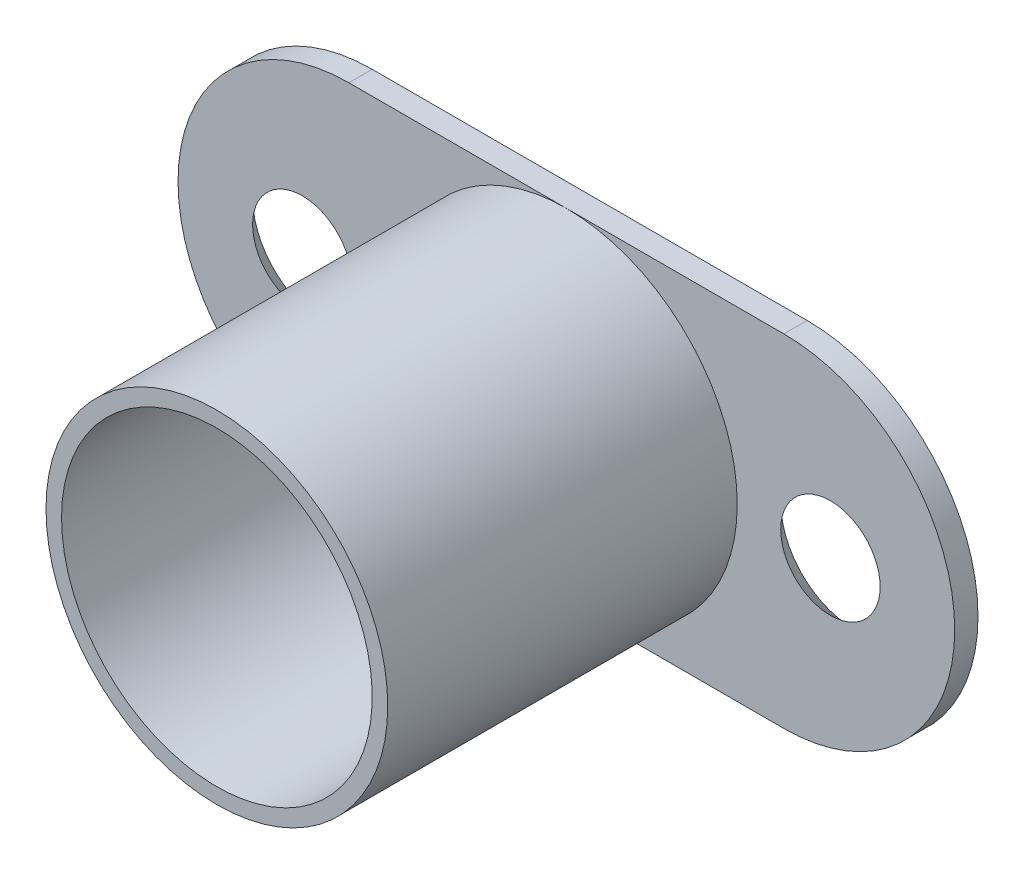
ISO-10303-21;
HEADER;
FILE_DESCRIPTION(('STEP AP214'),'2;1');
FILE_NAME('part.step','',(''),(''),'','','');
FILE_SCHEMA(('AUTOMOTIVE_DESIGN { 1 0 10303 214 1 1 1 1 }'));
ENDSEC;
DATA;
#1=APPLICATION_CONTEXT('core data for automotive mechanical design processes');
#2=APPLICATION_PROTOCOL_DEFINITION('international standard','automotive_design',2000,#1);
#3=PRODUCT_CONTEXT('',#1,'mechanical');
#4=PRODUCT('Part','Part','',(#3));
#5=PRODUCT_RELATED_PRODUCT_CATEGORY('part','',(#4));
#6=PRODUCT_DEFINITION_FORMATION('','',#4);
#7=PRODUCT_DEFINITION_CONTEXT('part definition',#1,'design');
#8=PRODUCT_DEFINITION('design','',#6,#7);
#9=PRODUCT_DEFINITION_SHAPE('','',#8);
#10=(LENGTH_UNIT() NAMED_UNIT(*) SI_UNIT(.MILLI.,.METRE.));
#11=(NAMED_UNIT(*) PLANE_ANGLE_UNIT() SI_UNIT($,.RADIAN.));
#12=(NAMED_UNIT(*) SI_UNIT($,.STERADIAN.) SOLID_ANGLE_UNIT());
#13=UNCERTAINTY_MEASURE_WITH_UNIT(LENGTH_MEASURE(1.E-05),#10,'distance_accuracy_value','');
#14=(GEOMETRIC_REPRESENTATION_CONTEXT(3) GLOBAL_UNCERTAINTY_ASSIGNED_CONTEXT((#13)) GLOBAL_UNIT_ASSIGNED_CONTEXT((#10,
#11,#12)) REPRESENTATION_CONTEXT('',''));
#15=CARTESIAN_POINT('',(0.,0.,0.));
#16=DIRECTION('',(0.,0.,1.));
#17=DIRECTION('',(1.,0.,0.));
#18=AXIS2_PLACEMENT_3D('',#15,#16,#17);
#19=CARTESIAN_POINT('',(0.,0.,0.));
#20=DIRECTION('',(0.,0.,1.));
#21=DIRECTION('',(1.,0.,0.));
#22=AXIS2_PLACEMENT_3D('',#19,#20,#21);
#23=PLANE('',#22);
#24=CARTESIAN_POINT('',(-3.,0.,0.));
#25=DIRECTION('',(0.,0.,1.));
#26=DIRECTION('',(1.,0.,0.));
#27=AXIS2_PLACEMENT_3D('',#24,#25,#26);
#28=CIRCLE('',#27,3.2);
#29=CARTESIAN_POINT('',(0.200000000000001,0.,0.));
#30=VERTEX_POINT('',#29);
#31=EDGE_CURVE('E134',#30,#30,#28,.T.);
#32=ORIENTED_EDGE('',*,*,#31,.F.);
#33=EDGE_LOOP('',(#32));
#34=FACE_BOUND('',#33,.T.);
#35=CARTESIAN_POINT('',(14.,0.,0.));
#36=DIRECTION('',(0.,0.,1.));
#37=DIRECTION('',(1.,0.,0.));
#38=AXIS2_PLACEMENT_3D('',#35,#36,#37);
#39=CIRCLE('',#38,11.);
#40=CARTESIAN_POINT('',(14.,11.,0.));
#41=VERTEX_POINT('',#40);
#42=CARTESIAN_POINT('',(14.,-11.,0.));
#43=VERTEX_POINT('',#42);
#44=EDGE_CURVE('E35',#41,#43,#39,.T.);
#45=ORIENTED_EDGE('',*,*,#44,.F.);
#46=DIRECTION('',(-1.,0.,0.));
#47=VECTOR('',#46,1.);
#48=CARTESIAN_POINT('',(0.,11.,0.));
#49=LINE('',#48,#47);
#50=CARTESIAN_POINT('',(0.,11.,0.));
#51=VERTEX_POINT('',#50);
#52=EDGE_CURVE('E79',#41,#51,#49,.T.);
#53=ORIENTED_EDGE('',*,*,#52,.T.);
#54=CARTESIAN_POINT('',(0.,0.,0.));
#55=DIRECTION('',(0.,0.,1.));
#56=DIRECTION('',(1.,0.,0.));
#57=AXIS2_PLACEMENT_3D('',#54,#55,#56);
#58=CIRCLE('',#57,11.);
#59=CARTESIAN_POINT('',(0.,-11.,0.));
#60=VERTEX_POINT('',#59);
#61=EDGE_CURVE('E154',#51,#60,#58,.T.);
#62=ORIENTED_EDGE('',*,*,#61,.T.);
#63=DIRECTION('',(1.,0.,0.));
#64=VECTOR('',#63,1.);
#65=CARTESIAN_POINT('',(0.,-11.,0.));
#66=LINE('',#65,#64);
#67=EDGE_CURVE('E89',#60,#43,#66,.T.);
#68=ORIENTED_EDGE('',*,*,#67,.T.);
#69=EDGE_LOOP('',(#45,#53,#62,#68));
#70=FACE_BOUND('',#69,.T.);
#71=ADVANCED_FACE('F24',(#34,#70),#23,.T.);
#72=CARTESIAN_POINT('',(0.,0.,-1.5));
#73=DIRECTION('',(0.,0.,1.));
#74=DIRECTION('',(1.,0.,0.));
#75=AXIS2_PLACEMENT_3D('',#72,#73,#74);
#76=CYLINDRICAL_SURFACE('',#75,11.);
#77=ORIENTED_EDGE('',*,*,#61,.F.);
#78=DIRECTION('',(0.,0.,1.));
#79=VECTOR('',#78,1.);
#80=CARTESIAN_POINT('',(0.,11.,-1.5));
#81=LINE('',#80,#79);
#82=CARTESIAN_POINT('',(0.,11.,-1.5));
#83=VERTEX_POINT('',#82);
#84=EDGE_CURVE('E33',#83,#51,#81,.T.);
#85=ORIENTED_EDGE('',*,*,#84,.F.);
#86=CARTESIAN_POINT('',(0.,0.,-1.5));
#87=DIRECTION('',(0.,0.,1.));
#88=DIRECTION('',(1.,0.,0.));
#89=AXIS2_PLACEMENT_3D('',#86,#87,#88);
#90=CIRCLE('',#89,11.);
#91=CARTESIAN_POINT('',(0.,-11.,-1.5));
#92=VERTEX_POINT('',#91);
#93=EDGE_CURVE('E78',#83,#92,#90,.T.);
#94=ORIENTED_EDGE('',*,*,#93,.T.);
#95=DIRECTION('',(0.,0.,1.));
#96=VECTOR('',#95,1.);
#97=CARTESIAN_POINT('',(0.,-11.,-1.5));
#98=LINE('',#97,#96);
#99=EDGE_CURVE('E168',#92,#60,#98,.T.);
#100=ORIENTED_EDGE('',*,*,#99,.T.);
#101=EDGE_LOOP('',(#77,#85,#94,#100));
#102=FACE_BOUND('',#101,.T.);
#103=ADVANCED_FACE('F26',(#102),#76,.T.);
#104=CARTESIAN_POINT('',(0.,11.,-1.5));
#105=DIRECTION('',(0.,1.,0.));
#106=DIRECTION('',(-1.,0.,0.));
#107=AXIS2_PLACEMENT_3D('',#104,#105,#106);
#108=PLANE('',#107);
#109=CARTESIAN_POINT('',(28.,11.,0.));
#110=VERTEX_POINT('',#109);
#111=EDGE_CURVE('E72',#110,#41,#49,.T.);
#112=ORIENTED_EDGE('',*,*,#111,.F.);
#113=DIRECTION('',(0.,0.,1.));
#114=VECTOR('',#113,1.);
#115=CARTESIAN_POINT('',(28.,11.,-1.5));
#116=LINE('',#115,#114);
#117=CARTESIAN_POINT('',(28.,11.,-1.5));
#118=VERTEX_POINT('',#117);
#119=EDGE_CURVE('E170',#118,#110,#116,.T.);
#120=ORIENTED_EDGE('',*,*,#119,.F.);
#121=DIRECTION('',(-1.,0.,0.));
#122=VECTOR('',#121,1.);
#123=CARTESIAN_POINT('',(0.,11.,-1.5));
#124=LINE('',#123,#122);
#125=EDGE_CURVE('E166',#118,#83,#124,.T.);
#126=ORIENTED_EDGE('',*,*,#125,.T.);
#127=ORIENTED_EDGE('',*,*,#84,.T.);
#128=ORIENTED_EDGE('',*,*,#52,.F.);
#129=EDGE_LOOP('',(#112,#120,#126,#127,#128));
#130=FACE_BOUND('',#129,.T.);
#131=ADVANCED_FACE('F82',(#130),#108,.T.);
#132=CARTESIAN_POINT('',(28.,0.,-1.5));
#133=DIRECTION('',(0.,0.,1.));
#134=DIRECTION('',(1.,0.,0.));
#135=AXIS2_PLACEMENT_3D('',#132,#133,#134);
#136=CYLINDRICAL_SURFACE('',#135,11.);
#137=CARTESIAN_POINT('',(28.,0.,0.));
#138=DIRECTION('',(0.,0.,1.));
#139=DIRECTION('',(1.,0.,0.));
#140=AXIS2_PLACEMENT_3D('',#137,#138,#139);
#141=CIRCLE('',#140,11.);
#142=CARTESIAN_POINT('',(28.,-11.,0.));
#143=VERTEX_POINT('',#142);
#144=EDGE_CURVE('E76',#143,#110,#141,.T.);
#145=ORIENTED_EDGE('',*,*,#144,.F.);
#146=DIRECTION('',(0.,0.,1.));
#147=VECTOR('',#146,1.);
#148=CARTESIAN_POINT('',(28.,-11.,-1.5));
#149=LINE('',#148,#147);
#150=CARTESIAN_POINT('',(28.,-11.,-1.5));
#151=VERTEX_POINT('',#150);
#152=EDGE_CURVE('E172',#151,#143,#149,.T.);
#153=ORIENTED_EDGE('',*,*,#152,.F.);
#154=CARTESIAN_POINT('',(28.,0.,-1.5));
#155=DIRECTION('',(0.,0.,1.));
#156=DIRECTION('',(1.,0.,0.));
#157=AXIS2_PLACEMENT_3D('',#154,#155,#156);
#158=CIRCLE('',#157,11.);
#159=EDGE_CURVE('E163',#151,#118,#158,.T.);
#160=ORIENTED_EDGE('',*,*,#159,.T.);
#161=ORIENTED_EDGE('',*,*,#119,.T.);
#162=EDGE_LOOP('',(#145,#153,#160,#161));
#163=FACE_BOUND('',#162,.T.);
#164=ADVANCED_FACE('F191',(#163),#136,.T.);
#165=CARTESIAN_POINT('',(0.,-11.,-1.5));
#166=DIRECTION('',(0.,-1.,0.));
#167=DIRECTION('',(0.,0.,-1.));
#168=AXIS2_PLACEMENT_3D('',#165,#166,#167);
#169=PLANE('',#168);
#170=ORIENTED_EDGE('',*,*,#67,.F.);
#171=ORIENTED_EDGE('',*,*,#99,.F.);
#172=DIRECTION('',(1.,0.,0.));
#173=VECTOR('',#172,1.);
#174=CARTESIAN_POINT('',(0.,-11.,-1.5));
#175=LINE('',#174,#173);
#176=EDGE_CURVE('E160',#92,#151,#175,.T.);
#177=ORIENTED_EDGE('',*,*,#176,.T.);
#178=ORIENTED_EDGE('',*,*,#152,.T.);
#179=EDGE_CURVE('E156',#43,#143,#66,.T.);
#180=ORIENTED_EDGE('',*,*,#179,.F.);
#181=EDGE_LOOP('',(#170,#171,#177,#178,#180));
#182=FACE_BOUND('',#181,.T.);
#183=ADVANCED_FACE('F126',(#182),#169,.T.);
#184=CARTESIAN_POINT('',(0.,0.,-1.5));
#185=DIRECTION('',(0.,0.,1.));
#186=DIRECTION('',(1.,0.,0.));
#187=AXIS2_PLACEMENT_3D('',#184,#185,#186);
#188=PLANE('',#187);
#189=CARTESIAN_POINT('',(31.,0.,-1.5));
#190=DIRECTION('',(0.,0.,-1.));
#191=DIRECTION('',(-1.,0.,0.));
#192=AXIS2_PLACEMENT_3D('',#189,#190,#191);
#193=CIRCLE('',#192,4.7);
#194=CARTESIAN_POINT('',(26.3,0.,-1.5));
#195=VERTEX_POINT('',#194);
#196=EDGE_CURVE('E132',#195,#195,#193,.T.);
#197=ORIENTED_EDGE('',*,*,#196,.F.);
#198=EDGE_LOOP('',(#197));
#199=FACE_BOUND('',#198,.T.);
#200=CARTESIAN_POINT('',(-3.,0.,-1.5));
#201=DIRECTION('',(0.,0.,-1.));
#202=DIRECTION('',(-1.,0.,0.));
#203=AXIS2_PLACEMENT_3D('',#200,#201,#202);
#204=CIRCLE('',#203,4.7);
#205=CARTESIAN_POINT('',(-7.7,0.,-1.5));
#206=VERTEX_POINT('',#205);
#207=EDGE_CURVE('E131',#206,#206,#204,.T.);
#208=ORIENTED_EDGE('',*,*,#207,.F.);
#209=EDGE_LOOP('',(#208));
#210=FACE_BOUND('',#209,.T.);
#211=CARTESIAN_POINT('',(14.,0.,-1.5));
#212=DIRECTION('',(0.,0.,1.));
#213=DIRECTION('',(1.,0.,0.));
#214=AXIS2_PLACEMENT_3D('',#211,#212,#213);
#215=CIRCLE('',#214,3.6);
#216=CARTESIAN_POINT('',(17.6,0.,-1.5));
#217=VERTEX_POINT('',#216);
#218=EDGE_CURVE('E144',#217,#217,#215,.T.);
#219=ORIENTED_EDGE('',*,*,#218,.T.);
#220=EDGE_LOOP('',(#219));
#221=FACE_BOUND('',#220,.T.);
#222=ORIENTED_EDGE('',*,*,#93,.F.);
#223=ORIENTED_EDGE('',*,*,#125,.F.);
#224=ORIENTED_EDGE('',*,*,#159,.F.);
#225=ORIENTED_EDGE('',*,*,#176,.F.);
#226=EDGE_LOOP('',(#222,#223,#224,#225));
#227=FACE_BOUND('',#226,.T.);
#228=ADVANCED_FACE('F121',(#199,#210,#221,#227),#188,.F.);
#229=CARTESIAN_POINT('',(31.,0.,0.));
#230=DIRECTION('',(0.,0.,1.));
#231=DIRECTION('',(1.,0.,0.));
#232=AXIS2_PLACEMENT_3D('',#229,#230,#231);
#233=CIRCLE('',#232,3.2);
#234=CARTESIAN_POINT('',(34.2,0.,0.));
#235=VERTEX_POINT('',#234);
#236=EDGE_CURVE('E28',#235,#235,#233,.T.);
#237=ORIENTED_EDGE('',*,*,#236,.F.);
#238=EDGE_LOOP('',(#237));
#239=FACE_BOUND('',#238,.T.);
#240=EDGE_CURVE('E11',#43,#41,#39,.T.);
#241=ORIENTED_EDGE('',*,*,#240,.F.);
#242=ORIENTED_EDGE('',*,*,#179,.T.);
#243=ORIENTED_EDGE('',*,*,#144,.T.);
#244=ORIENTED_EDGE('',*,*,#111,.T.);
#245=EDGE_LOOP('',(#241,#242,#243,#244));
#246=FACE_BOUND('',#245,.T.);
#247=ADVANCED_FACE('F74',(#239,#246),#23,.T.);
#248=CARTESIAN_POINT('',(14.,0.,22.5));
#249=DIRECTION('',(0.,0.,1.));
#250=DIRECTION('',(1.,0.,0.));
#251=AXIS2_PLACEMENT_3D('',#248,#249,#250);
#252=PLANE('',#251);
#253=CARTESIAN_POINT('',(14.,0.,22.5));
#254=DIRECTION('',(0.,0.,1.));
#255=DIRECTION('',(1.,0.,0.));
#256=AXIS2_PLACEMENT_3D('',#253,#254,#255);
#257=CIRCLE('',#256,11.);
#258=CARTESIAN_POINT('',(25.,0.,22.5));
#259=VERTEX_POINT('',#258);
#260=EDGE_CURVE('E91',#259,#259,#257,.T.);
#261=ORIENTED_EDGE('',*,*,#260,.T.);
#262=EDGE_LOOP('',(#261));
#263=FACE_BOUND('',#262,.T.);
#264=CARTESIAN_POINT('',(14.,0.,22.5));
#265=DIRECTION('',(0.,0.,1.));
#266=DIRECTION('',(1.,0.,0.));
#267=AXIS2_PLACEMENT_3D('',#264,#265,#266);
#268=CIRCLE('',#267,10.);
#269=CARTESIAN_POINT('',(4.,0.,22.5));
#270=VERTEX_POINT('',#269);
#271=EDGE_CURVE('E92',#270,#270,#268,.T.);
#272=ORIENTED_EDGE('',*,*,#271,.F.);
#273=EDGE_LOOP('',(#272));
#274=FACE_BOUND('',#273,.T.);
#275=ADVANCED_FACE('F96',(#263,#274),#252,.T.);
#276=CARTESIAN_POINT('',(14.,0.,22.5));
#277=DIRECTION('',(0.,0.,-1.));
#278=DIRECTION('',(-1.,0.,0.));
#279=AXIS2_PLACEMENT_3D('',#276,#277,#278);
#280=CYLINDRICAL_SURFACE('',#279,11.);
#281=ORIENTED_EDGE('',*,*,#260,.F.);
#282=EDGE_LOOP('',(#281));
#283=FACE_BOUND('',#282,.T.);
#284=ORIENTED_EDGE('',*,*,#44,.T.);
#285=ORIENTED_EDGE('',*,*,#240,.T.);
#286=EDGE_LOOP('',(#284,#285));
#287=FACE_BOUND('',#286,.T.);
#288=ADVANCED_FACE('F93',(#283,#287),#280,.T.);
#289=CARTESIAN_POINT('',(14.,0.,22.5));
#290=DIRECTION('',(0.,0.,-1.));
#291=DIRECTION('',(-1.,0.,0.));
#292=AXIS2_PLACEMENT_3D('',#289,#290,#291);
#293=CYLINDRICAL_SURFACE('',#292,10.);
#294=CARTESIAN_POINT('',(14.,0.,0.));
#295=DIRECTION('',(0.,0.,1.));
#296=DIRECTION('',(1.,0.,0.));
#297=AXIS2_PLACEMENT_3D('',#294,#295,#296);
#298=CIRCLE('',#297,10.);
#299=CARTESIAN_POINT('',(4.,0.,0.));
#300=VERTEX_POINT('',#299);
#301=EDGE_CURVE('E147',#300,#300,#298,.T.);
#302=CARTESIAN_POINT('',(4.,0.,22.5));
#303=CARTESIAN_POINT('',(4.,0.,22.265625));
#304=CARTESIAN_POINT('',(4.,0.,22.03125));
#305=CARTESIAN_POINT('',(4.,0.,21.5625));
#306=CARTESIAN_POINT('',(4.,0.,21.328125));
#307=CARTESIAN_POINT('',(4.,0.,20.859375));
#308=CARTESIAN_POINT('',(4.,0.,20.625));
#309=CARTESIAN_POINT('',(4.,0.,20.15625));
#310=CARTESIAN_POINT('',(4.,0.,19.921875));
#311=CARTESIAN_POINT('',(4.,0.,19.453125));
#312=CARTESIAN_POINT('',(4.,0.,19.21875));
#313=CARTESIAN_POINT('',(4.,0.,18.75));
#314=CARTESIAN_POINT('',(4.,0.,18.515625));
#315=CARTESIAN_POINT('',(4.,0.,18.046875));
#316=CARTESIAN_POINT('',(4.,0.,17.8125));
#317=CARTESIAN_POINT('',(4.,0.,17.34375));
#318=CARTESIAN_POINT('',(4.,0.,17.109375));
#319=CARTESIAN_POINT('',(4.,0.,16.640625));
#320=CARTESIAN_POINT('',(4.,0.,16.40625));
#321=CARTESIAN_POINT('',(4.,0.,15.9375));
#322=CARTESIAN_POINT('',(4.,0.,15.703125));
#323=CARTESIAN_POINT('',(4.,0.,15.234375));
#324=CARTESIAN_POINT('',(4.,0.,15.));
#325=CARTESIAN_POINT('',(4.,0.,14.53125));
#326=CARTESIAN_POINT('',(4.,0.,14.296875));
#327=CARTESIAN_POINT('',(4.,0.,13.828125));
#328=CARTESIAN_POINT('',(4.,0.,13.59375));
#329=CARTESIAN_POINT('',(4.,0.,13.125));
#330=CARTESIAN_POINT('',(4.,0.,12.890625));
#331=CARTESIAN_POINT('',(4.,0.,12.421875));
#332=CARTESIAN_POINT('',(4.,0.,12.1875));
#333=CARTESIAN_POINT('',(4.,0.,11.71875));
#334=CARTESIAN_POINT('',(4.,0.,11.484375));
#335=CARTESIAN_POINT('',(4.,0.,11.015625));
#336=CARTESIAN_POINT('',(4.,0.,10.78125));
#337=CARTESIAN_POINT('',(4.,0.,10.3125));
#338=CARTESIAN_POINT('',(4.,0.,10.078125));
#339=CARTESIAN_POINT('',(4.,0.,9.609375));
#340=CARTESIAN_POINT('',(4.,0.,9.375));
#341=CARTESIAN_POINT('',(4.,0.,8.90625));
#342=CARTESIAN_POINT('',(4.,0.,8.671875));
#343=CARTESIAN_POINT('',(4.,0.,8.203125));
#344=CARTESIAN_POINT('',(4.,0.,7.96875));
#345=CARTESIAN_POINT('',(4.,0.,7.5));
#346=CARTESIAN_POINT('',(4.,0.,7.265625));
#347=CARTESIAN_POINT('',(4.,0.,6.796875));
#348=CARTESIAN_POINT('',(4.,0.,6.5625));
#349=CARTESIAN_POINT('',(4.,0.,6.09375));
#350=CARTESIAN_POINT('',(4.,0.,5.859375));
#351=CARTESIAN_POINT('',(4.,0.,5.390625));
#352=CARTESIAN_POINT('',(4.,0.,5.15625));
#353=CARTESIAN_POINT('',(4.,0.,4.6875));
#354=CARTESIAN_POINT('',(4.,0.,4.453125));
#355=CARTESIAN_POINT('',(4.,0.,3.984375));
#356=CARTESIAN_POINT('',(4.,0.,3.75));
#357=CARTESIAN_POINT('',(4.,0.,3.28125));
#358=CARTESIAN_POINT('',(4.,0.,3.046875));
#359=CARTESIAN_POINT('',(4.,0.,2.578125));
#360=CARTESIAN_POINT('',(4.,0.,2.34375));
#361=CARTESIAN_POINT('',(4.,0.,1.875));
#362=CARTESIAN_POINT('',(4.,0.,1.640625));
#363=CARTESIAN_POINT('',(4.,0.,1.171875));
#364=CARTESIAN_POINT('',(4.,0.,0.937499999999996));
#365=CARTESIAN_POINT('',(4.,0.,0.468749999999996));
#366=CARTESIAN_POINT('',(4.,0.,0.234374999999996));
#367=CARTESIAN_POINT('',(4.,0.,0.));
#368=B_SPLINE_CURVE_WITH_KNOTS('',3,(#302,#303,#304,#305,#306,#307,#308,#309,#310,#311,#312,
#313,#314,#315,#316,#317,#318,#319,#320,#321,#322,#323,#324,#325,#326,#327,#328,#329,#330,#331,
#332,#333,#334,#335,#336,#337,#338,#339,#340,#341,#342,#343,#344,#345,#346,#347,#348,#349,#350,
#351,#352,#353,#354,#355,#356,#357,#358,#359,#360,#361,#362,#363,#364,#365,#366,#367),
.UNSPECIFIED.,.F.,.F.,(4,2,2,2,2,2,2,2,2,2,2,2,2,2,2,2,2,2,2,2,2,2,2,2,2,2,2,2,2,2,2,2,4),(0.,
0.703124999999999,1.40625,2.109375,2.8125,3.515625,4.21875,4.921875,5.625,6.328125,7.03125,
7.734375,8.4375,9.140625,9.84375,10.546875,11.25,11.953125,12.65625,13.359375,14.0625,14.765625,
15.46875,16.171875,16.875,17.578125,18.28125,18.984375,19.6875,20.390625,21.09375,21.796875,
22.5),.UNSPECIFIED.);
#369=EDGE_CURVE('BSEAM95',#270,#300,#368,.T.);
#370=ORIENTED_EDGE('',*,*,#271,.T.);
#371=ORIENTED_EDGE('',*,*,#301,.F.);
#372=ORIENTED_EDGE('',*,*,#369,.T.);
#373=ORIENTED_EDGE('',*,*,#369,.F.);
#374=EDGE_LOOP('',(#370,#372,#371,#373));
#375=FACE_BOUND('',#374,.T.);
#376=ADVANCED_FACE('F95',(#375),#293,.F.);
#377=CARTESIAN_POINT('',(14.,0.,0.));
#378=DIRECTION('',(0.,0.,1.));
#379=DIRECTION('',(1.,0.,0.));
#380=AXIS2_PLACEMENT_3D('',#377,#378,#379);
#381=CIRCLE('',#380,3.6);
#382=CARTESIAN_POINT('',(17.6,0.,0.));
#383=VERTEX_POINT('',#382);
#384=EDGE_CURVE('E141',#383,#383,#381,.T.);
#385=ORIENTED_EDGE('',*,*,#384,.F.);
#386=EDGE_LOOP('',(#385));
#387=FACE_BOUND('',#386,.T.);
#388=ORIENTED_EDGE('',*,*,#301,.T.);
#389=EDGE_LOOP('',(#388));
#390=FACE_BOUND('',#389,.T.);
#391=ADVANCED_FACE('F103',(#387,#390),#23,.T.);
#392=CARTESIAN_POINT('',(14.,0.,-1.5));
#393=DIRECTION('',(0.,0.,1.));
#394=DIRECTION('',(1.,0.,0.));
#395=AXIS2_PLACEMENT_3D('',#392,#393,#394);
#396=CYLINDRICAL_SURFACE('',#395,3.6);
#397=ORIENTED_EDGE('',*,*,#218,.F.);
#398=EDGE_LOOP('',(#397));
#399=FACE_BOUND('',#398,.T.);
#400=ORIENTED_EDGE('',*,*,#384,.T.);
#401=EDGE_LOOP('',(#400));
#402=FACE_BOUND('',#401,.T.);
#403=ADVANCED_FACE('F118',(#399,#402),#396,.F.);
#404=CARTESIAN_POINT('',(-3.,0.,-1.5));
#405=DIRECTION('',(0.,0.,-1.));
#406=DIRECTION('',(-1.,0.,0.));
#407=AXIS2_PLACEMENT_3D('',#404,#405,#406);
#408=CONICAL_SURFACE('',#407,4.7,0.785398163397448);
#409=ORIENTED_EDGE('',*,*,#31,.T.);
#410=EDGE_LOOP('',(#409));
#411=FACE_BOUND('',#410,.T.);
#412=ORIENTED_EDGE('',*,*,#207,.T.);
#413=EDGE_LOOP('',(#412));
#414=FACE_BOUND('',#413,.T.);
#415=ADVANCED_FACE('F177',(#411,#414),#408,.F.);
#416=CARTESIAN_POINT('',(31.,0.,-1.5));
#417=DIRECTION('',(0.,0.,-1.));
#418=DIRECTION('',(-1.,0.,0.));
#419=AXIS2_PLACEMENT_3D('',#416,#417,#418);
#420=CONICAL_SURFACE('',#419,4.7,0.785398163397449);
#421=ORIENTED_EDGE('',*,*,#236,.T.);
#422=EDGE_LOOP('',(#421));
#423=FACE_BOUND('',#422,.T.);
#424=ORIENTED_EDGE('',*,*,#196,.T.);
#425=EDGE_LOOP('',(#424));
#426=FACE_BOUND('',#425,.T.);
#427=ADVANCED_FACE('F180',(#423,#426),#420,.F.);
#428=CLOSED_SHELL('',(#71,#103,#131,#164,#183,#228,#247,#275,#288,#376,#391,#403,#415,#427));
#429=MANIFOLD_SOLID_BREP('B2',#428);
#430=ADVANCED_BREP_SHAPE_REPRESENTATION('',(#18,#429),#14);
#431=SHAPE_DEFINITION_REPRESENTATION(#9,#430);
ENDSEC;
END-ISO-10303-21;
